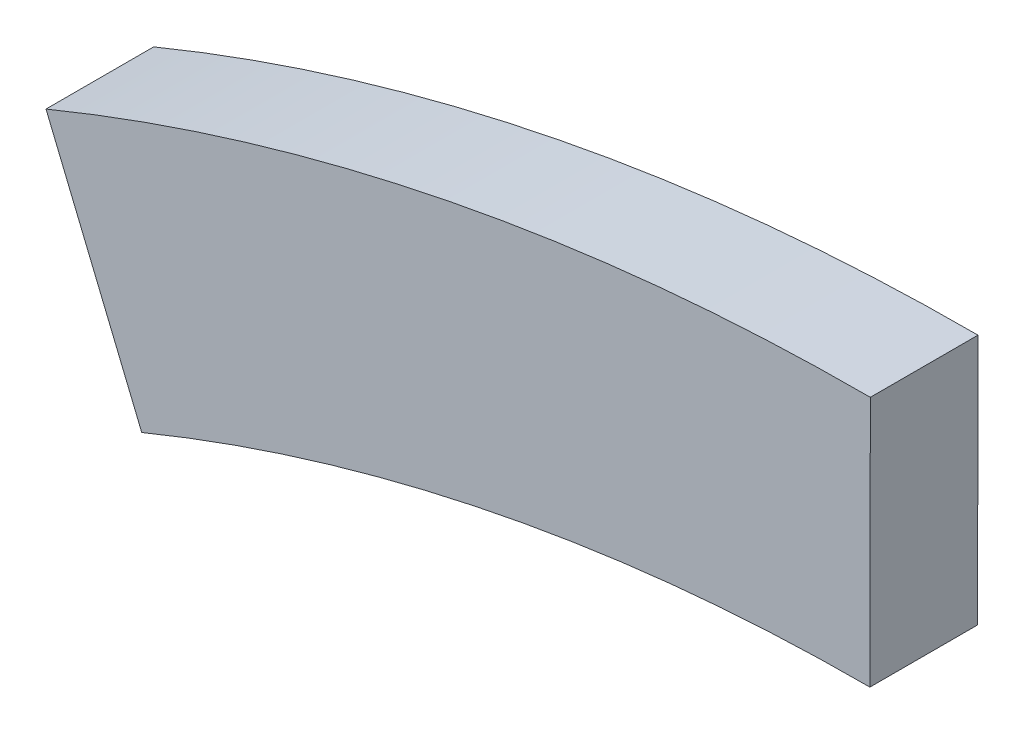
ISO-10303-21;
HEADER;
FILE_DESCRIPTION(('STEP AP214'),'2;1');
FILE_NAME('part.step','',(''),(''),'','','');
FILE_SCHEMA(('AUTOMOTIVE_DESIGN { 1 0 10303 214 1 1 1 1 }'));
ENDSEC;
DATA;
#1=APPLICATION_CONTEXT('core data for automotive mechanical design processes');
#2=APPLICATION_PROTOCOL_DEFINITION('international standard','automotive_design',2000,#1);
#3=PRODUCT_CONTEXT('',#1,'mechanical');
#4=PRODUCT('Part','Part','',(#3));
#5=PRODUCT_RELATED_PRODUCT_CATEGORY('part','',(#4));
#6=PRODUCT_DEFINITION_FORMATION('','',#4);
#7=PRODUCT_DEFINITION_CONTEXT('part definition',#1,'design');
#8=PRODUCT_DEFINITION('design','',#6,#7);
#9=PRODUCT_DEFINITION_SHAPE('','',#8);
#10=(LENGTH_UNIT() NAMED_UNIT(*) SI_UNIT(.MILLI.,.METRE.));
#11=(NAMED_UNIT(*) PLANE_ANGLE_UNIT() SI_UNIT($,.RADIAN.));
#12=(NAMED_UNIT(*) SI_UNIT($,.STERADIAN.) SOLID_ANGLE_UNIT());
#13=UNCERTAINTY_MEASURE_WITH_UNIT(LENGTH_MEASURE(1.E-05),#10,'distance_accuracy_value','');
#14=(GEOMETRIC_REPRESENTATION_CONTEXT(3) GLOBAL_UNCERTAINTY_ASSIGNED_CONTEXT((#13)) GLOBAL_UNIT_ASSIGNED_CONTEXT((#10,
#11,#12)) REPRESENTATION_CONTEXT('',''));
#15=CARTESIAN_POINT('',(0.,0.,0.));
#16=DIRECTION('',(0.,0.,1.));
#17=DIRECTION('',(1.,0.,0.));
#18=AXIS2_PLACEMENT_3D('',#15,#16,#17);
#19=CARTESIAN_POINT('',(256.527425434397,-622.3,38.1));
#20=DIRECTION('',(0.,0.,-1.));
#21=DIRECTION('',(-1.,0.,0.));
#22=AXIS2_PLACEMENT_3D('',#19,#20,#21);
#23=CYLINDRICAL_SURFACE('',#22,762.);
#24=CARTESIAN_POINT('',(256.527425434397,-622.3,0.));
#25=DIRECTION('',(0.,0.,1.));
#26=DIRECTION('',(1.,0.,0.));
#27=AXIS2_PLACEMENT_3D('',#24,#25,#26);
#28=CIRCLE('',#27,762.);
#29=CARTESIAN_POINT('',(-33.8809807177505,82.1905660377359,0.));
#30=VERTEX_POINT('',#29);
#31=CARTESIAN_POINT('',(257.821910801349,139.698900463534,0.));
#32=VERTEX_POINT('',#31);
#33=EDGE_CURVE('E101',#30,#32,#28,.F.);
#34=ORIENTED_EDGE('',*,*,#33,.F.);
#35=DIRECTION('',(0.,0.,-1.));
#36=VECTOR('',#35,1.);
#37=CARTESIAN_POINT('',(-33.8809807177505,82.1905660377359,38.1));
#38=LINE('',#37,#36);
#39=CARTESIAN_POINT('',(-33.8809807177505,82.1905660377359,38.1));
#40=VERTEX_POINT('',#39);
#41=EDGE_CURVE('E11',#40,#30,#38,.T.);
#42=ORIENTED_EDGE('',*,*,#41,.F.);
#43=CARTESIAN_POINT('',(256.527425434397,-622.3,38.1));
#44=DIRECTION('',(0.,0.,1.));
#45=DIRECTION('',(1.,0.,0.));
#46=AXIS2_PLACEMENT_3D('',#43,#44,#45);
#47=CIRCLE('',#46,762.);
#48=CARTESIAN_POINT('',(257.821910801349,139.698900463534,38.1));
#49=VERTEX_POINT('',#48);
#50=EDGE_CURVE('E95',#40,#49,#47,.F.);
#51=ORIENTED_EDGE('',*,*,#50,.T.);
#52=DIRECTION('',(0.,0.,-1.));
#53=VECTOR('',#52,1.);
#54=CARTESIAN_POINT('',(257.821910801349,139.698900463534,38.1));
#55=LINE('',#54,#53);
#56=EDGE_CURVE('E76',#49,#32,#55,.T.);
#57=ORIENTED_EDGE('',*,*,#56,.T.);
#58=EDGE_LOOP('',(#34,#42,#51,#57));
#59=FACE_BOUND('',#58,.T.);
#60=ADVANCED_FACE('F38',(#59),#23,.T.);
#61=CARTESIAN_POINT('',(0.,0.,38.1));
#62=DIRECTION('',(-0.924528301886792,-0.381113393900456,0.));
#63=DIRECTION('',(0.381113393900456,-0.924528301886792,0.));
#64=AXIS2_PLACEMENT_3D('',#61,#62,#63);
#65=PLANE('',#64);
#66=DIRECTION('',(-0.381113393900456,0.924528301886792,0.));
#67=VECTOR('',#66,1.);
#68=CARTESIAN_POINT('',(0.,0.,0.));
#69=LINE('',#68,#67);
#70=CARTESIAN_POINT('',(0.,0.,0.));
#71=VERTEX_POINT('',#70);
#72=EDGE_CURVE('E89',#71,#30,#69,.T.);
#73=ORIENTED_EDGE('',*,*,#72,.F.);
#74=DIRECTION('',(0.,0.,-1.));
#75=VECTOR('',#74,1.);
#76=CARTESIAN_POINT('',(0.,0.,38.1));
#77=LINE('',#76,#75);
#78=CARTESIAN_POINT('',(0.,0.,38.1));
#79=VERTEX_POINT('',#78);
#80=EDGE_CURVE('E46',#79,#71,#77,.T.);
#81=ORIENTED_EDGE('',*,*,#80,.F.);
#82=DIRECTION('',(-0.381113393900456,0.924528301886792,0.));
#83=VECTOR('',#82,1.);
#84=CARTESIAN_POINT('',(0.,0.,38.1));
#85=LINE('',#84,#83);
#86=EDGE_CURVE('E87',#79,#40,#85,.T.);
#87=ORIENTED_EDGE('',*,*,#86,.T.);
#88=ORIENTED_EDGE('',*,*,#41,.T.);
#89=EDGE_LOOP('',(#73,#81,#87,#88));
#90=FACE_BOUND('',#89,.T.);
#91=ADVANCED_FACE('F85',(#90),#65,.T.);
#92=CARTESIAN_POINT('',(256.527425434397,-622.3,38.1));
#93=DIRECTION('',(0.,0.,-1.));
#94=DIRECTION('',(-1.,0.,0.));
#95=AXIS2_PLACEMENT_3D('',#92,#93,#94);
#96=CYLINDRICAL_SURFACE('',#95,673.1);
#97=CARTESIAN_POINT('',(256.527425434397,-622.3,0.));
#98=DIRECTION('',(0.,0.,1.));
#99=DIRECTION('',(1.,0.,0.));
#100=AXIS2_PLACEMENT_3D('',#97,#98,#99);
#101=CIRCLE('',#100,673.1);
#102=CARTESIAN_POINT('',(257.670887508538,50.7990287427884,0.));
#103=VERTEX_POINT('',#102);
#104=EDGE_CURVE('E69',#71,#103,#101,.F.);
#105=ORIENTED_EDGE('',*,*,#104,.T.);
#106=DIRECTION('',(0.,0.,-1.));
#107=VECTOR('',#106,1.);
#108=CARTESIAN_POINT('',(257.670887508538,50.7990287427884,38.1));
#109=LINE('',#108,#107);
#110=CARTESIAN_POINT('',(257.670887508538,50.7990287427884,38.1));
#111=VERTEX_POINT('',#110);
#112=EDGE_CURVE('E90',#111,#103,#109,.T.);
#113=ORIENTED_EDGE('',*,*,#112,.F.);
#114=CARTESIAN_POINT('',(256.527425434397,-622.3,38.1));
#115=DIRECTION('',(0.,0.,1.));
#116=DIRECTION('',(1.,0.,0.));
#117=AXIS2_PLACEMENT_3D('',#114,#115,#116);
#118=CIRCLE('',#117,673.1);
#119=EDGE_CURVE('E91',#79,#111,#118,.F.);
#120=ORIENTED_EDGE('',*,*,#119,.F.);
#121=ORIENTED_EDGE('',*,*,#80,.T.);
#122=EDGE_LOOP('',(#105,#113,#120,#121));
#123=FACE_BOUND('',#122,.T.);
#124=ADVANCED_FACE('F92',(#123),#96,.F.);
#125=CARTESIAN_POINT('',(257.583846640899,-0.437583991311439,38.1));
#126=DIRECTION('',(-0.999998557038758,0.00169879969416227,0.));
#127=DIRECTION('',(-0.00169879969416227,-0.999998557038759,0.));
#128=AXIS2_PLACEMENT_3D('',#125,#126,#127);
#129=PLANE('',#128);
#130=DIRECTION('',(0.00169879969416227,0.999998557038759,0.));
#131=VECTOR('',#130,1.);
#132=CARTESIAN_POINT('',(257.583846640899,-0.437583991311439,0.));
#133=LINE('',#132,#131);
#134=EDGE_CURVE('E97',#103,#32,#133,.T.);
#135=ORIENTED_EDGE('',*,*,#134,.T.);
#136=ORIENTED_EDGE('',*,*,#56,.F.);
#137=DIRECTION('',(0.00169879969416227,0.999998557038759,0.));
#138=VECTOR('',#137,1.);
#139=CARTESIAN_POINT('',(257.583846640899,-0.437583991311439,38.1));
#140=LINE('',#139,#138);
#141=EDGE_CURVE('E54',#111,#49,#140,.T.);
#142=ORIENTED_EDGE('',*,*,#141,.F.);
#143=ORIENTED_EDGE('',*,*,#112,.T.);
#144=EDGE_LOOP('',(#135,#136,#142,#143));
#145=FACE_BOUND('',#144,.T.);
#146=ADVANCED_FACE('F110',(#145),#129,.F.);
#147=CARTESIAN_POINT('',(0.,0.,38.1));
#148=DIRECTION('',(0.,0.,1.));
#149=DIRECTION('',(1.,0.,0.));
#150=AXIS2_PLACEMENT_3D('',#147,#148,#149);
#151=PLANE('',#150);
#152=ORIENTED_EDGE('',*,*,#50,.F.);
#153=ORIENTED_EDGE('',*,*,#86,.F.);
#154=ORIENTED_EDGE('',*,*,#119,.T.);
#155=ORIENTED_EDGE('',*,*,#141,.T.);
#156=EDGE_LOOP('',(#152,#153,#154,#155));
#157=FACE_BOUND('',#156,.T.);
#158=ADVANCED_FACE('F94',(#157),#151,.T.);
#159=CARTESIAN_POINT('',(0.,0.,0.));
#160=DIRECTION('',(0.,0.,1.));
#161=DIRECTION('',(1.,0.,0.));
#162=AXIS2_PLACEMENT_3D('',#159,#160,#161);
#163=PLANE('',#162);
#164=ORIENTED_EDGE('',*,*,#33,.T.);
#165=ORIENTED_EDGE('',*,*,#134,.F.);
#166=ORIENTED_EDGE('',*,*,#104,.F.);
#167=ORIENTED_EDGE('',*,*,#72,.T.);
#168=EDGE_LOOP('',(#164,#165,#166,#167));
#169=FACE_BOUND('',#168,.T.);
#170=ADVANCED_FACE('F112',(#169),#163,.F.);
#171=CLOSED_SHELL('',(#60,#91,#124,#146,#158,#170));
#172=MANIFOLD_SOLID_BREP('B2',#171);
#173=ADVANCED_BREP_SHAPE_REPRESENTATION('',(#18,#172),#14);
#174=SHAPE_DEFINITION_REPRESENTATION(#9,#173);
ENDSEC;
END-ISO-10303-21;
